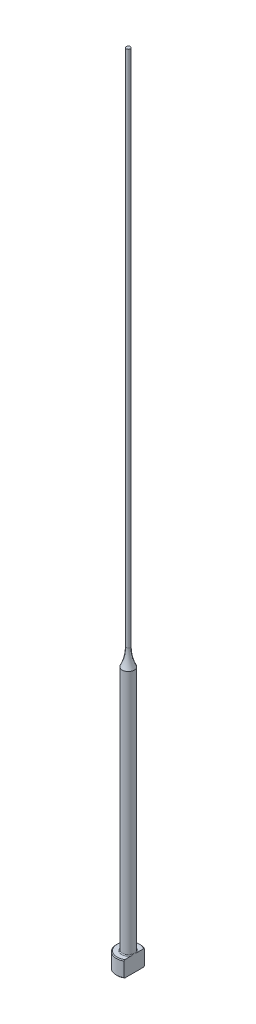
from build123d import *
from build123d.topology import SkipClean

# Parameters (mm, degrees)
CHAMFER1_SIZE    = 0.2
FILLET1_R        = 0.2
KEYED_HEAD_DEPTH = 201.044994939


with BuildPart() as part:
    # Sketch1 → Revolve1 (revolve)
    with BuildSketch(Plane.XY, mode=Mode.PRIVATE) as revolve1_sk:
        with BuildLine():
            Line((0, 0), (-3, 0))
            Line((-3, 0), (-3, 4))
            Line((-3, 4), (-1.5, 4))
            Line((-1.5, 4), (-1.5, 65.641101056))
            ThreePointArc((-1.5, 65.641101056), (-0.753205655, 67.763932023), (-0.5, 70))
            Line((-0.5, 70), (-0.5, 200))
            Line((-0.5, 200), (0, 200))
            Line((0, 200), (0, 0))
        make_face()
    revolve(revolve1_sk.sketch.rotate(Axis((0, 259.958771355, 0), (0, -1, 0)), 270), axis=Axis((0, 259.958771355, 0), (0, -1, 0)))

    # Chamfer1
    chamfer1_edges = [part.edges().sort_by_distance(p)[0] for p in [
        (0, 0, -3),
        (0, 4, -3),
    ]]
    chamfer(chamfer1_edges, length=CHAMFER1_SIZE)

    # Fillet1
    fillet1_edges = [part.edges().sort_by_distance(p)[0] for p in [
        (0, 4, -1.5),
    ]]
    fillet(fillet1_edges, radius=FILLET1_R)

    # Sketch2 → Keyed Head (cut, through all)
    with SkipClean():  # the faces are left unmerged after this step: merging them gives an invalid solid
        with BuildSketch(Plane(origin=(0, 0, 0), x_dir=(1, 0, 0), z_dir=(0, 1, 0))):
            with BuildLine():
                Line((1.5, -2.598076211), (1.5, 2.598076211))
                ThreePointArc((1.5, 2.598076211), (3, 0), (1.5, -2.598076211))
            make_face()
        extrude(amount=KEYED_HEAD_DEPTH, mode=Mode.SUBTRACT)


solid = part.part
